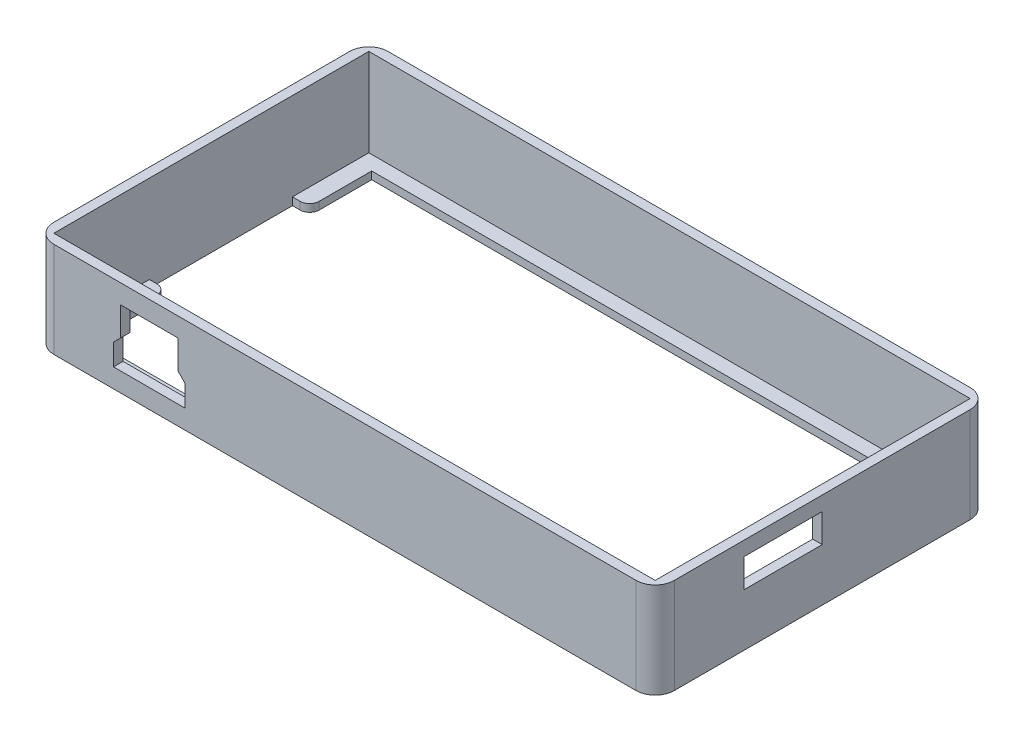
ISO-10303-21;
HEADER;
FILE_DESCRIPTION(('STEP AP214'),'2;1');
FILE_NAME('part.step','',(''),(''),'','','');
FILE_SCHEMA(('AUTOMOTIVE_DESIGN { 1 0 10303 214 1 1 1 1 }'));
ENDSEC;
DATA;
#1=APPLICATION_CONTEXT('core data for automotive mechanical design processes');
#2=APPLICATION_PROTOCOL_DEFINITION('international standard','automotive_design',2000,#1);
#3=PRODUCT_CONTEXT('',#1,'mechanical');
#4=PRODUCT('Part','Part','',(#3));
#5=PRODUCT_RELATED_PRODUCT_CATEGORY('part','',(#4));
#6=PRODUCT_DEFINITION_FORMATION('','',#4);
#7=PRODUCT_DEFINITION_CONTEXT('part definition',#1,'design');
#8=PRODUCT_DEFINITION('design','',#6,#7);
#9=PRODUCT_DEFINITION_SHAPE('','',#8);
#10=(LENGTH_UNIT() NAMED_UNIT(*) SI_UNIT(.MILLI.,.METRE.));
#11=(NAMED_UNIT(*) PLANE_ANGLE_UNIT() SI_UNIT($,.RADIAN.));
#12=(NAMED_UNIT(*) SI_UNIT($,.STERADIAN.) SOLID_ANGLE_UNIT());
#13=UNCERTAINTY_MEASURE_WITH_UNIT(LENGTH_MEASURE(1.E-05),#10,'distance_accuracy_value','');
#14=(GEOMETRIC_REPRESENTATION_CONTEXT(3) GLOBAL_UNCERTAINTY_ASSIGNED_CONTEXT((#13)) GLOBAL_UNIT_ASSIGNED_CONTEXT((#10,
#11,#12)) REPRESENTATION_CONTEXT('',''));
#15=CARTESIAN_POINT('',(0.,0.,0.));
#16=DIRECTION('',(0.,0.,1.));
#17=DIRECTION('',(1.,0.,0.));
#18=AXIS2_PLACEMENT_3D('',#15,#16,#17);
#19=CARTESIAN_POINT('',(0.,0.8,0.));
#20=DIRECTION('',(0.,-1.,0.));
#21=DIRECTION('',(0.,0.,-1.));
#22=AXIS2_PLACEMENT_3D('',#19,#20,#21);
#23=PLANE('',#22);
#24=DIRECTION('',(0.,0.,1.));
#25=VECTOR('',#24,1.);
#26=CARTESIAN_POINT('',(-29.7,0.8,6.49999999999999));
#27=LINE('',#26,#25);
#28=CARTESIAN_POINT('',(-29.7,0.8,7.49999999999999));
#29=VERTEX_POINT('',#28);
#30=CARTESIAN_POINT('',(-29.7,0.8,15.));
#31=VERTEX_POINT('',#30);
#32=EDGE_CURVE('E315',#29,#31,#27,.T.);
#33=ORIENTED_EDGE('',*,*,#32,.F.);
#34=CARTESIAN_POINT('',(-30.7,0.8,7.49999999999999));
#35=DIRECTION('',(0.,-1.,0.));
#36=DIRECTION('',(0.,0.,-1.));
#37=AXIS2_PLACEMENT_3D('',#34,#35,#36);
#38=CIRCLE('',#37,1.);
#39=CARTESIAN_POINT('',(-30.7,0.8,6.49999999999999));
#40=VERTEX_POINT('',#39);
#41=EDGE_CURVE('E410',#29,#40,#38,.F.);
#42=ORIENTED_EDGE('',*,*,#41,.T.);
#43=DIRECTION('',(1.,0.,0.));
#44=VECTOR('',#43,1.);
#45=CARTESIAN_POINT('',(-31.5,0.8,6.49999999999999));
#46=LINE('',#45,#44);
#47=CARTESIAN_POINT('',(-31.5,0.8,6.49999999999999));
#48=VERTEX_POINT('',#47);
#49=EDGE_CURVE('E340',#48,#40,#46,.T.);
#50=ORIENTED_EDGE('',*,*,#49,.F.);
#51=DIRECTION('',(0.,0.,1.));
#52=VECTOR('',#51,1.);
#53=CARTESIAN_POINT('',(-31.5,0.8,0.));
#54=LINE('',#53,#52);
#55=CARTESIAN_POINT('',(-31.5,0.8,16.5));
#56=VERTEX_POINT('',#55);
#57=EDGE_CURVE('E541',#48,#56,#54,.T.);
#58=ORIENTED_EDGE('',*,*,#57,.T.);
#59=DIRECTION('',(1.,0.,0.));
#60=VECTOR('',#59,1.);
#61=CARTESIAN_POINT('',(0.,0.8,16.5));
#62=LINE('',#61,#60);
#63=CARTESIAN_POINT('',(31.5,0.8,16.5));
#64=VERTEX_POINT('',#63);
#65=EDGE_CURVE('E595',#56,#64,#62,.T.);
#66=ORIENTED_EDGE('',*,*,#65,.T.);
#67=DIRECTION('',(0.,0.,-1.));
#68=VECTOR('',#67,1.);
#69=CARTESIAN_POINT('',(31.5,0.8,0.));
#70=LINE('',#69,#68);
#71=CARTESIAN_POINT('',(31.5,0.8,-16.5));
#72=VERTEX_POINT('',#71);
#73=EDGE_CURVE('E568',#64,#72,#70,.T.);
#74=ORIENTED_EDGE('',*,*,#73,.T.);
#75=DIRECTION('',(-1.,0.,0.));
#76=VECTOR('',#75,1.);
#77=CARTESIAN_POINT('',(0.,0.8,-16.5));
#78=LINE('',#77,#76);
#79=CARTESIAN_POINT('',(-31.5,0.8,-16.5));
#80=VERTEX_POINT('',#79);
#81=EDGE_CURVE('E571',#72,#80,#78,.T.);
#82=ORIENTED_EDGE('',*,*,#81,.T.);
#83=CARTESIAN_POINT('',(-31.5,0.8,-8.5));
#84=VERTEX_POINT('',#83);
#85=EDGE_CURVE('E592',#80,#84,#54,.T.);
#86=ORIENTED_EDGE('',*,*,#85,.T.);
#87=DIRECTION('',(-1.,0.,0.));
#88=VECTOR('',#87,1.);
#89=CARTESIAN_POINT('',(-31.5,0.8,-8.5));
#90=LINE('',#89,#88);
#91=CARTESIAN_POINT('',(-30.7,0.8,-8.5));
#92=VERTEX_POINT('',#91);
#93=EDGE_CURVE('E405',#92,#84,#90,.T.);
#94=ORIENTED_EDGE('',*,*,#93,.F.);
#95=CARTESIAN_POINT('',(-30.7,0.8,-9.5));
#96=DIRECTION('',(0.,-1.,0.));
#97=DIRECTION('',(0.,0.,-1.));
#98=AXIS2_PLACEMENT_3D('',#95,#96,#97);
#99=CIRCLE('',#98,1.);
#100=CARTESIAN_POINT('',(-29.7,0.8,-9.5));
#101=VERTEX_POINT('',#100);
#102=EDGE_CURVE('E404',#92,#101,#99,.F.);
#103=ORIENTED_EDGE('',*,*,#102,.T.);
#104=DIRECTION('',(0.,0.,1.));
#105=VECTOR('',#104,1.);
#106=CARTESIAN_POINT('',(-29.7,0.8,-8.5));
#107=LINE('',#106,#105);
#108=CARTESIAN_POINT('',(-29.7,0.8,-15.));
#109=VERTEX_POINT('',#108);
#110=EDGE_CURVE('E408',#109,#101,#107,.T.);
#111=ORIENTED_EDGE('',*,*,#110,.F.);
#112=DIRECTION('',(-1.,0.,0.));
#113=VECTOR('',#112,1.);
#114=CARTESIAN_POINT('',(-29.7,0.8,-15.));
#115=LINE('',#114,#113);
#116=CARTESIAN_POINT('',(30.5,0.8,-15.));
#117=VERTEX_POINT('',#116);
#118=EDGE_CURVE('E656',#117,#109,#115,.T.);
#119=ORIENTED_EDGE('',*,*,#118,.F.);
#120=DIRECTION('',(0.,0.,-1.));
#121=VECTOR('',#120,1.);
#122=CARTESIAN_POINT('',(30.5,0.8,-15.));
#123=LINE('',#122,#121);
#124=CARTESIAN_POINT('',(30.5,0.8,15.));
#125=VERTEX_POINT('',#124);
#126=EDGE_CURVE('E343',#125,#117,#123,.T.);
#127=ORIENTED_EDGE('',*,*,#126,.F.);
#128=DIRECTION('',(1.,0.,0.));
#129=VECTOR('',#128,1.);
#130=CARTESIAN_POINT('',(30.5,0.8,15.));
#131=LINE('',#130,#129);
#132=EDGE_CURVE('E559',#31,#125,#131,.T.);
#133=ORIENTED_EDGE('',*,*,#132,.F.);
#134=EDGE_LOOP('',(#33,#42,#50,#58,#66,#74,#82,#86,#94,#103,#111,#119,#127,#133));
#135=FACE_BOUND('',#134,.T.);
#136=ADVANCED_FACE('F37',(#135),#23,.F.);
#137=CARTESIAN_POINT('',(0.,10.,0.));
#138=DIRECTION('',(0.,-1.,0.));
#139=DIRECTION('',(0.,0.,-1.));
#140=AXIS2_PLACEMENT_3D('',#137,#138,#139);
#141=PLANE('',#140);
#142=DIRECTION('',(0.,0.,-1.));
#143=VECTOR('',#142,1.);
#144=CARTESIAN_POINT('',(32.5,10.,17.5));
#145=LINE('',#144,#143);
#146=CARTESIAN_POINT('',(32.5,10.,15.5));
#147=VERTEX_POINT('',#146);
#148=CARTESIAN_POINT('',(32.5,10.,-15.5));
#149=VERTEX_POINT('',#148);
#150=EDGE_CURVE('E599',#147,#149,#145,.T.);
#151=ORIENTED_EDGE('',*,*,#150,.T.);
#152=CARTESIAN_POINT('',(30.5,10.,-15.5));
#153=DIRECTION('',(0.,-1.,0.));
#154=DIRECTION('',(0.,0.,-1.));
#155=AXIS2_PLACEMENT_3D('',#152,#153,#154);
#156=CIRCLE('',#155,2.);
#157=CARTESIAN_POINT('',(30.5,10.,-17.5));
#158=VERTEX_POINT('',#157);
#159=EDGE_CURVE('E383',#149,#158,#156,.F.);
#160=ORIENTED_EDGE('',*,*,#159,.T.);
#161=DIRECTION('',(-1.,0.,0.));
#162=VECTOR('',#161,1.);
#163=CARTESIAN_POINT('',(-32.5,10.,-17.5));
#164=LINE('',#163,#162);
#165=CARTESIAN_POINT('',(-30.5,10.,-17.5));
#166=VERTEX_POINT('',#165);
#167=EDGE_CURVE('E613',#158,#166,#164,.T.);
#168=ORIENTED_EDGE('',*,*,#167,.T.);
#169=CARTESIAN_POINT('',(-30.5,10.,-15.5));
#170=DIRECTION('',(0.,-1.,0.));
#171=DIRECTION('',(0.,0.,-1.));
#172=AXIS2_PLACEMENT_3D('',#169,#170,#171);
#173=CIRCLE('',#172,2.);
#174=CARTESIAN_POINT('',(-32.5,10.,-15.5));
#175=VERTEX_POINT('',#174);
#176=EDGE_CURVE('E379',#166,#175,#173,.F.);
#177=ORIENTED_EDGE('',*,*,#176,.T.);
#178=DIRECTION('',(0.,0.,1.));
#179=VECTOR('',#178,1.);
#180=CARTESIAN_POINT('',(-32.5,10.,17.5));
#181=LINE('',#180,#179);
#182=CARTESIAN_POINT('',(-32.5,10.,15.5));
#183=VERTEX_POINT('',#182);
#184=EDGE_CURVE('E610',#175,#183,#181,.T.);
#185=ORIENTED_EDGE('',*,*,#184,.T.);
#186=CARTESIAN_POINT('',(-30.5,10.,15.5));
#187=DIRECTION('',(0.,-1.,0.));
#188=DIRECTION('',(0.,0.,-1.));
#189=AXIS2_PLACEMENT_3D('',#186,#187,#188);
#190=CIRCLE('',#189,2.);
#191=CARTESIAN_POINT('',(-30.5,10.,17.5));
#192=VERTEX_POINT('',#191);
#193=EDGE_CURVE('E377',#183,#192,#190,.F.);
#194=ORIENTED_EDGE('',*,*,#193,.T.);
#195=DIRECTION('',(1.,0.,0.));
#196=VECTOR('',#195,1.);
#197=CARTESIAN_POINT('',(-32.5,10.,17.5));
#198=LINE('',#197,#196);
#199=CARTESIAN_POINT('',(30.5,10.,17.5));
#200=VERTEX_POINT('',#199);
#201=EDGE_CURVE('E361',#192,#200,#198,.T.);
#202=ORIENTED_EDGE('',*,*,#201,.T.);
#203=CARTESIAN_POINT('',(30.5,10.,15.5));
#204=DIRECTION('',(0.,-1.,0.));
#205=DIRECTION('',(0.,0.,-1.));
#206=AXIS2_PLACEMENT_3D('',#203,#204,#205);
#207=CIRCLE('',#206,2.);
#208=EDGE_CURVE('E381',#200,#147,#207,.F.);
#209=ORIENTED_EDGE('',*,*,#208,.T.);
#210=EDGE_LOOP('',(#151,#160,#168,#177,#185,#194,#202,#209));
#211=FACE_BOUND('',#210,.T.);
#212=DIRECTION('',(0.,0.,-1.));
#213=VECTOR('',#212,1.);
#214=CARTESIAN_POINT('',(31.5,10.,0.));
#215=LINE('',#214,#213);
#216=CARTESIAN_POINT('',(31.5,10.,16.5));
#217=VERTEX_POINT('',#216);
#218=CARTESIAN_POINT('',(31.5,10.,-16.5));
#219=VERTEX_POINT('',#218);
#220=EDGE_CURVE('E624',#217,#219,#215,.T.);
#221=ORIENTED_EDGE('',*,*,#220,.F.);
#222=DIRECTION('',(1.,0.,0.));
#223=VECTOR('',#222,1.);
#224=CARTESIAN_POINT('',(0.,10.,16.5));
#225=LINE('',#224,#223);
#226=CARTESIAN_POINT('',(-31.5,10.,16.5));
#227=VERTEX_POINT('',#226);
#228=EDGE_CURVE('E581',#227,#217,#225,.T.);
#229=ORIENTED_EDGE('',*,*,#228,.F.);
#230=DIRECTION('',(0.,0.,1.));
#231=VECTOR('',#230,1.);
#232=CARTESIAN_POINT('',(-31.5,10.,0.));
#233=LINE('',#232,#231);
#234=CARTESIAN_POINT('',(-31.5,10.,-16.5));
#235=VERTEX_POINT('',#234);
#236=EDGE_CURVE('E619',#235,#227,#233,.T.);
#237=ORIENTED_EDGE('',*,*,#236,.F.);
#238=DIRECTION('',(-1.,0.,0.));
#239=VECTOR('',#238,1.);
#240=CARTESIAN_POINT('',(0.,10.,-16.5));
#241=LINE('',#240,#239);
#242=EDGE_CURVE('E622',#219,#235,#241,.T.);
#243=ORIENTED_EDGE('',*,*,#242,.F.);
#244=EDGE_LOOP('',(#221,#229,#237,#243));
#245=FACE_BOUND('',#244,.T.);
#246=ADVANCED_FACE('F467',(#211,#245),#141,.F.);
#247=CARTESIAN_POINT('',(32.5,10.,17.5));
#248=DIRECTION('',(-1.,0.,0.));
#249=DIRECTION('',(0.,0.,1.));
#250=AXIS2_PLACEMENT_3D('',#247,#248,#249);
#251=PLANE('',#250);
#252=DIRECTION('',(0.,1.,0.));
#253=VECTOR('',#252,1.);
#254=CARTESIAN_POINT('',(32.5,5.5,0.));
#255=LINE('',#254,#253);
#256=CARTESIAN_POINT('',(32.5,5.5,0.));
#257=VERTEX_POINT('',#256);
#258=CARTESIAN_POINT('',(32.5,8.5,0.));
#259=VERTEX_POINT('',#258);
#260=EDGE_CURVE('E319',#257,#259,#255,.T.);
#261=ORIENTED_EDGE('',*,*,#260,.F.);
#262=DIRECTION('',(0.,0.,-1.));
#263=VECTOR('',#262,1.);
#264=CARTESIAN_POINT('',(32.5,5.5,8.2));
#265=LINE('',#264,#263);
#266=CARTESIAN_POINT('',(32.5,5.5,8.2));
#267=VERTEX_POINT('',#266);
#268=EDGE_CURVE('E322',#267,#257,#265,.T.);
#269=ORIENTED_EDGE('',*,*,#268,.F.);
#270=DIRECTION('',(0.,-1.,0.));
#271=VECTOR('',#270,1.);
#272=CARTESIAN_POINT('',(32.5,8.5,8.2));
#273=LINE('',#272,#271);
#274=CARTESIAN_POINT('',(32.5,8.5,8.2));
#275=VERTEX_POINT('',#274);
#276=EDGE_CURVE('E312',#275,#267,#273,.T.);
#277=ORIENTED_EDGE('',*,*,#276,.F.);
#278=DIRECTION('',(0.,0.,1.));
#279=VECTOR('',#278,1.);
#280=CARTESIAN_POINT('',(32.5,8.5,0.));
#281=LINE('',#280,#279);
#282=EDGE_CURVE('E316',#259,#275,#281,.T.);
#283=ORIENTED_EDGE('',*,*,#282,.F.);
#284=EDGE_LOOP('',(#261,#269,#277,#283));
#285=FACE_BOUND('',#284,.T.);
#286=DIRECTION('',(0.,0.,-1.));
#287=VECTOR('',#286,1.);
#288=CARTESIAN_POINT('',(32.5,0.,17.5));
#289=LINE('',#288,#287);
#290=CARTESIAN_POINT('',(32.5,0.,15.5));
#291=VERTEX_POINT('',#290);
#292=CARTESIAN_POINT('',(32.5,0.,-15.5));
#293=VERTEX_POINT('',#292);
#294=EDGE_CURVE('E575',#291,#293,#289,.T.);
#295=ORIENTED_EDGE('',*,*,#294,.T.);
#296=DIRECTION('',(0.,-1.,0.));
#297=VECTOR('',#296,1.);
#298=CARTESIAN_POINT('',(32.5,10.,-15.5));
#299=LINE('',#298,#297);
#300=EDGE_CURVE('E375',#293,#149,#299,.F.);
#301=ORIENTED_EDGE('',*,*,#300,.T.);
#302=ORIENTED_EDGE('',*,*,#150,.F.);
#303=DIRECTION('',(0.,-1.,0.));
#304=VECTOR('',#303,1.);
#305=CARTESIAN_POINT('',(32.5,10.,15.5));
#306=LINE('',#305,#304);
#307=EDGE_CURVE('E372',#147,#291,#306,.T.);
#308=ORIENTED_EDGE('',*,*,#307,.T.);
#309=EDGE_LOOP('',(#295,#301,#302,#308));
#310=FACE_BOUND('',#309,.T.);
#311=ADVANCED_FACE('F473',(#285,#310),#251,.F.);
#312=CARTESIAN_POINT('',(-32.5,10.,-17.5));
#313=DIRECTION('',(0.,0.,1.));
#314=DIRECTION('',(1.,0.,0.));
#315=AXIS2_PLACEMENT_3D('',#312,#313,#314);
#316=PLANE('',#315);
#317=ORIENTED_EDGE('',*,*,#167,.F.);
#318=DIRECTION('',(0.,-1.,0.));
#319=VECTOR('',#318,1.);
#320=CARTESIAN_POINT('',(30.5,10.,-17.5));
#321=LINE('',#320,#319);
#322=CARTESIAN_POINT('',(30.5,0.,-17.5));
#323=VERTEX_POINT('',#322);
#324=EDGE_CURVE('E360',#158,#323,#321,.T.);
#325=ORIENTED_EDGE('',*,*,#324,.T.);
#326=DIRECTION('',(-1.,0.,0.));
#327=VECTOR('',#326,1.);
#328=CARTESIAN_POINT('',(-32.5,0.,-17.5));
#329=LINE('',#328,#327);
#330=CARTESIAN_POINT('',(-30.5,0.,-17.5));
#331=VERTEX_POINT('',#330);
#332=EDGE_CURVE('E603',#323,#331,#329,.T.);
#333=ORIENTED_EDGE('',*,*,#332,.T.);
#334=DIRECTION('',(0.,-1.,0.));
#335=VECTOR('',#334,1.);
#336=CARTESIAN_POINT('',(-30.5,10.,-17.5));
#337=LINE('',#336,#335);
#338=EDGE_CURVE('E358',#331,#166,#337,.F.);
#339=ORIENTED_EDGE('',*,*,#338,.T.);
#340=EDGE_LOOP('',(#317,#325,#333,#339));
#341=FACE_BOUND('',#340,.T.);
#342=ADVANCED_FACE('F490',(#341),#316,.F.);
#343=CARTESIAN_POINT('',(-32.5,10.,17.5));
#344=DIRECTION('',(1.,0.,0.));
#345=DIRECTION('',(0.,0.,-1.));
#346=AXIS2_PLACEMENT_3D('',#343,#344,#345);
#347=PLANE('',#346);
#348=ORIENTED_EDGE('',*,*,#184,.F.);
#349=DIRECTION('',(0.,-1.,0.));
#350=VECTOR('',#349,1.);
#351=CARTESIAN_POINT('',(-32.5,10.,-15.5));
#352=LINE('',#351,#350);
#353=CARTESIAN_POINT('',(-32.5,0.,-15.5));
#354=VERTEX_POINT('',#353);
#355=EDGE_CURVE('E392',#175,#354,#352,.T.);
#356=ORIENTED_EDGE('',*,*,#355,.T.);
#357=DIRECTION('',(0.,0.,1.));
#358=VECTOR('',#357,1.);
#359=CARTESIAN_POINT('',(-32.5,0.,17.5));
#360=LINE('',#359,#358);
#361=CARTESIAN_POINT('',(-32.5,0.,15.5));
#362=VERTEX_POINT('',#361);
#363=EDGE_CURVE('E600',#354,#362,#360,.T.);
#364=ORIENTED_EDGE('',*,*,#363,.T.);
#365=DIRECTION('',(0.,-1.,0.));
#366=VECTOR('',#365,1.);
#367=CARTESIAN_POINT('',(-32.5,10.,15.5));
#368=LINE('',#367,#366);
#369=EDGE_CURVE('E390',#362,#183,#368,.F.);
#370=ORIENTED_EDGE('',*,*,#369,.T.);
#371=EDGE_LOOP('',(#348,#356,#364,#370));
#372=FACE_BOUND('',#371,.T.);
#373=ADVANCED_FACE('F487',(#372),#347,.F.);
#374=CARTESIAN_POINT('',(-32.5,10.,17.5));
#375=DIRECTION('',(0.,0.,-1.));
#376=DIRECTION('',(-1.,0.,0.));
#377=AXIS2_PLACEMENT_3D('',#374,#375,#376);
#378=PLANE('',#377);
#379=DIRECTION('',(0.,1.,0.));
#380=VECTOR('',#379,1.);
#381=CARTESIAN_POINT('',(-16.75,4.25,17.5));
#382=LINE('',#381,#380);
#383=CARTESIAN_POINT('',(-16.75,2.,17.5));
#384=VERTEX_POINT('',#383);
#385=CARTESIAN_POINT('',(-16.75,4.25,17.5));
#386=VERTEX_POINT('',#385);
#387=EDGE_CURVE('E269',#384,#386,#382,.T.);
#388=ORIENTED_EDGE('',*,*,#387,.F.);
#389=DIRECTION('',(1.,0.,0.));
#390=VECTOR('',#389,1.);
#391=CARTESIAN_POINT('',(-23.5,2.,17.5));
#392=LINE('',#391,#390);
#393=CARTESIAN_POINT('',(-24.25,2.,17.5));
#394=VERTEX_POINT('',#393);
#395=EDGE_CURVE('E52',#394,#384,#392,.T.);
#396=ORIENTED_EDGE('',*,*,#395,.F.);
#397=DIRECTION('',(0.,-1.,0.));
#398=VECTOR('',#397,1.);
#399=CARTESIAN_POINT('',(-24.25,4.24999999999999,17.5));
#400=LINE('',#399,#398);
#401=CARTESIAN_POINT('',(-24.25,4.24999999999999,17.5));
#402=VERTEX_POINT('',#401);
#403=EDGE_CURVE('E290',#402,#394,#400,.T.);
#404=ORIENTED_EDGE('',*,*,#403,.F.);
#405=DIRECTION('',(-0.707106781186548,-0.707106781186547,0.));
#406=VECTOR('',#405,1.);
#407=CARTESIAN_POINT('',(-23.5,5.,17.5));
#408=LINE('',#407,#406);
#409=CARTESIAN_POINT('',(-23.5,5.,17.5));
#410=VERTEX_POINT('',#409);
#411=EDGE_CURVE('E287',#410,#402,#408,.T.);
#412=ORIENTED_EDGE('',*,*,#411,.F.);
#413=DIRECTION('',(0.,-1.,0.));
#414=VECTOR('',#413,1.);
#415=CARTESIAN_POINT('',(-23.5,8.,17.5));
#416=LINE('',#415,#414);
#417=CARTESIAN_POINT('',(-23.5,8.,17.5));
#418=VERTEX_POINT('',#417);
#419=EDGE_CURVE('E284',#418,#410,#416,.T.);
#420=ORIENTED_EDGE('',*,*,#419,.F.);
#421=DIRECTION('',(-1.,0.,0.));
#422=VECTOR('',#421,1.);
#423=CARTESIAN_POINT('',(-23.5,8.,17.5));
#424=LINE('',#423,#422);
#425=CARTESIAN_POINT('',(-17.5,8.,17.5));
#426=VERTEX_POINT('',#425);
#427=EDGE_CURVE('E279',#426,#418,#424,.T.);
#428=ORIENTED_EDGE('',*,*,#427,.F.);
#429=DIRECTION('',(0.,1.,0.));
#430=VECTOR('',#429,1.);
#431=CARTESIAN_POINT('',(-17.5,8.,17.5));
#432=LINE('',#431,#430);
#433=CARTESIAN_POINT('',(-17.5,5.,17.5));
#434=VERTEX_POINT('',#433);
#435=EDGE_CURVE('E277',#434,#426,#432,.T.);
#436=ORIENTED_EDGE('',*,*,#435,.F.);
#437=DIRECTION('',(-0.707106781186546,0.707106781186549,0.));
#438=VECTOR('',#437,1.);
#439=CARTESIAN_POINT('',(-17.5,5.,17.5));
#440=LINE('',#439,#438);
#441=EDGE_CURVE('E260',#386,#434,#440,.T.);
#442=ORIENTED_EDGE('',*,*,#441,.F.);
#443=EDGE_LOOP('',(#388,#396,#404,#412,#420,#428,#436,#442));
#444=FACE_BOUND('',#443,.T.);
#445=DIRECTION('',(1.,0.,0.));
#446=VECTOR('',#445,1.);
#447=CARTESIAN_POINT('',(-32.5,0.,17.5));
#448=LINE('',#447,#446);
#449=CARTESIAN_POINT('',(-30.5,0.,17.5));
#450=VERTEX_POINT('',#449);
#451=CARTESIAN_POINT('',(30.5,0.,17.5));
#452=VERTEX_POINT('',#451);
#453=EDGE_CURVE('E596',#450,#452,#448,.T.);
#454=ORIENTED_EDGE('',*,*,#453,.T.);
#455=DIRECTION('',(0.,-1.,0.));
#456=VECTOR('',#455,1.);
#457=CARTESIAN_POINT('',(30.5,10.,17.5));
#458=LINE('',#457,#456);
#459=EDGE_CURVE('E388',#452,#200,#458,.F.);
#460=ORIENTED_EDGE('',*,*,#459,.T.);
#461=ORIENTED_EDGE('',*,*,#201,.F.);
#462=DIRECTION('',(0.,-1.,0.));
#463=VECTOR('',#462,1.);
#464=CARTESIAN_POINT('',(-30.5,10.,17.5));
#465=LINE('',#464,#463);
#466=EDGE_CURVE('E385',#192,#450,#465,.T.);
#467=ORIENTED_EDGE('',*,*,#466,.T.);
#468=EDGE_LOOP('',(#454,#460,#461,#467));
#469=FACE_BOUND('',#468,.T.);
#470=ADVANCED_FACE('F273',(#444,#469),#378,.F.);
#471=CARTESIAN_POINT('',(0.,0.,0.));
#472=DIRECTION('',(0.,-1.,0.));
#473=DIRECTION('',(0.,0.,-1.));
#474=AXIS2_PLACEMENT_3D('',#471,#472,#473);
#475=PLANE('',#474);
#476=DIRECTION('',(-1.,0.,0.));
#477=VECTOR('',#476,1.);
#478=CARTESIAN_POINT('',(-31.5,0.,6.49999999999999));
#479=LINE('',#478,#477);
#480=CARTESIAN_POINT('',(-30.7,0.,6.49999999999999));
#481=VERTEX_POINT('',#480);
#482=CARTESIAN_POINT('',(-31.5,0.,6.49999999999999));
#483=VERTEX_POINT('',#482);
#484=EDGE_CURVE('E531',#481,#483,#479,.T.);
#485=ORIENTED_EDGE('',*,*,#484,.F.);
#486=CARTESIAN_POINT('',(-30.7,0.,7.49999999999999));
#487=DIRECTION('',(0.,-1.,0.));
#488=DIRECTION('',(0.,0.,-1.));
#489=AXIS2_PLACEMENT_3D('',#486,#487,#488);
#490=CIRCLE('',#489,1.);
#491=CARTESIAN_POINT('',(-29.7,0.,7.49999999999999));
#492=VERTEX_POINT('',#491);
#493=EDGE_CURVE('E400',#481,#492,#490,.T.);
#494=ORIENTED_EDGE('',*,*,#493,.T.);
#495=DIRECTION('',(0.,0.,-1.));
#496=VECTOR('',#495,1.);
#497=CARTESIAN_POINT('',(-29.7,0.,6.49999999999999));
#498=LINE('',#497,#496);
#499=CARTESIAN_POINT('',(-29.7,0.,15.));
#500=VERTEX_POINT('',#499);
#501=EDGE_CURVE('E548',#500,#492,#498,.T.);
#502=ORIENTED_EDGE('',*,*,#501,.F.);
#503=DIRECTION('',(-1.,0.,0.));
#504=VECTOR('',#503,1.);
#505=CARTESIAN_POINT('',(30.5,0.,15.));
#506=LINE('',#505,#504);
#507=CARTESIAN_POINT('',(30.5,0.,15.));
#508=VERTEX_POINT('',#507);
#509=EDGE_CURVE('E661',#508,#500,#506,.T.);
#510=ORIENTED_EDGE('',*,*,#509,.F.);
#511=DIRECTION('',(0.,0.,1.));
#512=VECTOR('',#511,1.);
#513=CARTESIAN_POINT('',(30.5,0.,-15.));
#514=LINE('',#513,#512);
#515=CARTESIAN_POINT('',(30.5,0.,-15.));
#516=VERTEX_POINT('',#515);
#517=EDGE_CURVE('E407',#516,#508,#514,.T.);
#518=ORIENTED_EDGE('',*,*,#517,.F.);
#519=DIRECTION('',(1.,0.,0.));
#520=VECTOR('',#519,1.);
#521=CARTESIAN_POINT('',(-29.7,0.,-15.));
#522=LINE('',#521,#520);
#523=CARTESIAN_POINT('',(-29.7,0.,-15.));
#524=VERTEX_POINT('',#523);
#525=EDGE_CURVE('E553',#524,#516,#522,.T.);
#526=ORIENTED_EDGE('',*,*,#525,.F.);
#527=DIRECTION('',(0.,0.,-1.));
#528=VECTOR('',#527,1.);
#529=CARTESIAN_POINT('',(-29.7,0.,-8.5));
#530=LINE('',#529,#528);
#531=CARTESIAN_POINT('',(-29.7,0.,-9.5));
#532=VERTEX_POINT('',#531);
#533=EDGE_CURVE('E546',#532,#524,#530,.T.);
#534=ORIENTED_EDGE('',*,*,#533,.F.);
#535=CARTESIAN_POINT('',(-30.7,0.,-9.5));
#536=DIRECTION('',(0.,-1.,0.));
#537=DIRECTION('',(0.,0.,-1.));
#538=AXIS2_PLACEMENT_3D('',#535,#536,#537);
#539=CIRCLE('',#538,1.);
#540=CARTESIAN_POINT('',(-30.7,0.,-8.5));
#541=VERTEX_POINT('',#540);
#542=EDGE_CURVE('E398',#532,#541,#539,.T.);
#543=ORIENTED_EDGE('',*,*,#542,.T.);
#544=DIRECTION('',(1.,0.,0.));
#545=VECTOR('',#544,1.);
#546=CARTESIAN_POINT('',(-31.5,0.,-8.5));
#547=LINE('',#546,#545);
#548=CARTESIAN_POINT('',(-31.5,0.,-8.5));
#549=VERTEX_POINT('',#548);
#550=EDGE_CURVE('E544',#549,#541,#547,.T.);
#551=ORIENTED_EDGE('',*,*,#550,.F.);
#552=DIRECTION('',(0.,0.,-1.));
#553=VECTOR('',#552,1.);
#554=CARTESIAN_POINT('',(-31.5,0.,6.49999999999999));
#555=LINE('',#554,#553);
#556=EDGE_CURVE('E538',#483,#549,#555,.T.);
#557=ORIENTED_EDGE('',*,*,#556,.F.);
#558=EDGE_LOOP('',(#485,#494,#502,#510,#518,#526,#534,#543,#551,#557));
#559=FACE_BOUND('',#558,.T.);
#560=ORIENTED_EDGE('',*,*,#332,.F.);
#561=CARTESIAN_POINT('',(30.5,0.,-15.5));
#562=DIRECTION('',(0.,-1.,0.));
#563=DIRECTION('',(0.,0.,-1.));
#564=AXIS2_PLACEMENT_3D('',#561,#562,#563);
#565=CIRCLE('',#564,2.);
#566=EDGE_CURVE('E370',#323,#293,#565,.T.);
#567=ORIENTED_EDGE('',*,*,#566,.T.);
#568=ORIENTED_EDGE('',*,*,#294,.F.);
#569=CARTESIAN_POINT('',(30.5,0.,15.5));
#570=DIRECTION('',(0.,-1.,0.));
#571=DIRECTION('',(0.,0.,-1.));
#572=AXIS2_PLACEMENT_3D('',#569,#570,#571);
#573=CIRCLE('',#572,2.);
#574=EDGE_CURVE('E368',#291,#452,#573,.T.);
#575=ORIENTED_EDGE('',*,*,#574,.T.);
#576=ORIENTED_EDGE('',*,*,#453,.F.);
#577=CARTESIAN_POINT('',(-30.5,0.,15.5));
#578=DIRECTION('',(0.,-1.,0.));
#579=DIRECTION('',(0.,0.,-1.));
#580=AXIS2_PLACEMENT_3D('',#577,#578,#579);
#581=CIRCLE('',#580,2.);
#582=EDGE_CURVE('E364',#450,#362,#581,.T.);
#583=ORIENTED_EDGE('',*,*,#582,.T.);
#584=ORIENTED_EDGE('',*,*,#363,.F.);
#585=CARTESIAN_POINT('',(-30.5,0.,-15.5));
#586=DIRECTION('',(0.,-1.,0.));
#587=DIRECTION('',(0.,0.,-1.));
#588=AXIS2_PLACEMENT_3D('',#585,#586,#587);
#589=CIRCLE('',#588,2.);
#590=EDGE_CURVE('E366',#354,#331,#589,.T.);
#591=ORIENTED_EDGE('',*,*,#590,.T.);
#592=EDGE_LOOP('',(#560,#567,#568,#575,#576,#583,#584,#591));
#593=FACE_BOUND('',#592,.T.);
#594=ADVANCED_FACE('F480',(#559,#593),#475,.T.);
#595=CARTESIAN_POINT('',(31.5,10.,17.5));
#596=DIRECTION('',(-1.,0.,0.));
#597=DIRECTION('',(0.,0.,1.));
#598=AXIS2_PLACEMENT_3D('',#595,#596,#597);
#599=PLANE('',#598);
#600=DIRECTION('',(0.,0.,-1.));
#601=VECTOR('',#600,1.);
#602=CARTESIAN_POINT('',(31.5,5.5,8.2));
#603=LINE('',#602,#601);
#604=CARTESIAN_POINT('',(31.5,5.5,8.2));
#605=VERTEX_POINT('',#604);
#606=CARTESIAN_POINT('',(31.5,5.5,0.));
#607=VERTEX_POINT('',#606);
#608=EDGE_CURVE('E296',#605,#607,#603,.T.);
#609=ORIENTED_EDGE('',*,*,#608,.T.);
#610=DIRECTION('',(0.,1.,0.));
#611=VECTOR('',#610,1.);
#612=CARTESIAN_POINT('',(31.5,5.5,0.));
#613=LINE('',#612,#611);
#614=CARTESIAN_POINT('',(31.5,8.5,0.));
#615=VERTEX_POINT('',#614);
#616=EDGE_CURVE('E307',#607,#615,#613,.T.);
#617=ORIENTED_EDGE('',*,*,#616,.T.);
#618=DIRECTION('',(0.,0.,1.));
#619=VECTOR('',#618,1.);
#620=CARTESIAN_POINT('',(31.5,8.5,0.));
#621=LINE('',#620,#619);
#622=CARTESIAN_POINT('',(31.5,8.5,8.2));
#623=VERTEX_POINT('',#622);
#624=EDGE_CURVE('E331',#615,#623,#621,.T.);
#625=ORIENTED_EDGE('',*,*,#624,.T.);
#626=DIRECTION('',(0.,-1.,0.));
#627=VECTOR('',#626,1.);
#628=CARTESIAN_POINT('',(31.5,8.5,8.2));
#629=LINE('',#628,#627);
#630=EDGE_CURVE('E327',#623,#605,#629,.T.);
#631=ORIENTED_EDGE('',*,*,#630,.T.);
#632=EDGE_LOOP('',(#609,#617,#625,#631));
#633=FACE_BOUND('',#632,.T.);
#634=ORIENTED_EDGE('',*,*,#73,.F.);
#635=DIRECTION('',(0.,-1.,0.));
#636=VECTOR('',#635,1.);
#637=CARTESIAN_POINT('',(31.5,10.,16.5));
#638=LINE('',#637,#636);
#639=EDGE_CURVE('E577',#217,#64,#638,.T.);
#640=ORIENTED_EDGE('',*,*,#639,.F.);
#641=ORIENTED_EDGE('',*,*,#220,.T.);
#642=DIRECTION('',(0.,-1.,0.));
#643=VECTOR('',#642,1.);
#644=CARTESIAN_POINT('',(31.5,10.,-16.5));
#645=LINE('',#644,#643);
#646=EDGE_CURVE('E572',#219,#72,#645,.T.);
#647=ORIENTED_EDGE('',*,*,#646,.T.);
#648=EDGE_LOOP('',(#634,#640,#641,#647));
#649=FACE_BOUND('',#648,.T.);
#650=ADVANCED_FACE('F483',(#633,#649),#599,.T.);
#651=CARTESIAN_POINT('',(-32.5,10.,-16.5));
#652=DIRECTION('',(0.,0.,1.));
#653=DIRECTION('',(1.,0.,0.));
#654=AXIS2_PLACEMENT_3D('',#651,#652,#653);
#655=PLANE('',#654);
#656=ORIENTED_EDGE('',*,*,#81,.F.);
#657=ORIENTED_EDGE('',*,*,#646,.F.);
#658=ORIENTED_EDGE('',*,*,#242,.T.);
#659=DIRECTION('',(0.,-1.,0.));
#660=VECTOR('',#659,1.);
#661=CARTESIAN_POINT('',(-31.5,10.,-16.5));
#662=LINE('',#661,#660);
#663=EDGE_CURVE('E576',#235,#80,#662,.T.);
#664=ORIENTED_EDGE('',*,*,#663,.T.);
#665=EDGE_LOOP('',(#656,#657,#658,#664));
#666=FACE_BOUND('',#665,.T.);
#667=ADVANCED_FACE('F634',(#666),#655,.T.);
#668=CARTESIAN_POINT('',(-31.5,10.,17.5));
#669=DIRECTION('',(1.,0.,0.));
#670=DIRECTION('',(0.,0.,-1.));
#671=AXIS2_PLACEMENT_3D('',#668,#669,#670);
#672=PLANE('',#671);
#673=ORIENTED_EDGE('',*,*,#85,.F.);
#674=ORIENTED_EDGE('',*,*,#663,.F.);
#675=ORIENTED_EDGE('',*,*,#236,.T.);
#676=DIRECTION('',(0.,-1.,0.));
#677=VECTOR('',#676,1.);
#678=CARTESIAN_POINT('',(-31.5,10.,16.5));
#679=LINE('',#678,#677);
#680=EDGE_CURVE('E580',#227,#56,#679,.T.);
#681=ORIENTED_EDGE('',*,*,#680,.T.);
#682=ORIENTED_EDGE('',*,*,#57,.F.);
#683=DIRECTION('',(0.,-1.,0.));
#684=VECTOR('',#683,1.);
#685=CARTESIAN_POINT('',(-31.5,10.001,6.49999999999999));
#686=LINE('',#685,#684);
#687=EDGE_CURVE('E351',#48,#483,#686,.T.);
#688=ORIENTED_EDGE('',*,*,#687,.T.);
#689=ORIENTED_EDGE('',*,*,#556,.T.);
#690=DIRECTION('',(0.,-1.,0.));
#691=VECTOR('',#690,1.);
#692=CARTESIAN_POINT('',(-31.5,10.001,-8.5));
#693=LINE('',#692,#691);
#694=EDGE_CURVE('E354',#84,#549,#693,.T.);
#695=ORIENTED_EDGE('',*,*,#694,.F.);
#696=EDGE_LOOP('',(#673,#674,#675,#681,#682,#688,#689,#695));
#697=FACE_BOUND('',#696,.T.);
#698=ADVANCED_FACE('F536',(#697),#672,.T.);
#699=CARTESIAN_POINT('',(-32.5,10.,16.5));
#700=DIRECTION('',(0.,0.,-1.));
#701=DIRECTION('',(-1.,0.,0.));
#702=AXIS2_PLACEMENT_3D('',#699,#700,#701);
#703=PLANE('',#702);
#704=DIRECTION('',(-1.,0.,0.));
#705=VECTOR('',#704,1.);
#706=CARTESIAN_POINT('',(-32.5,2.,16.5));
#707=LINE('',#706,#705);
#708=CARTESIAN_POINT('',(-16.75,2.,16.5));
#709=VERTEX_POINT('',#708);
#710=CARTESIAN_POINT('',(-24.25,2.,16.5));
#711=VERTEX_POINT('',#710);
#712=EDGE_CURVE('E11',#709,#711,#707,.T.);
#713=ORIENTED_EDGE('',*,*,#712,.F.);
#714=DIRECTION('',(0.,-1.,0.));
#715=VECTOR('',#714,1.);
#716=CARTESIAN_POINT('',(-16.75,10.,16.5));
#717=LINE('',#716,#715);
#718=CARTESIAN_POINT('',(-16.75,4.25,16.5));
#719=VERTEX_POINT('',#718);
#720=EDGE_CURVE('E417',#719,#709,#717,.T.);
#721=ORIENTED_EDGE('',*,*,#720,.F.);
#722=DIRECTION('',(0.707106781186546,-0.707106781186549,0.));
#723=VECTOR('',#722,1.);
#724=CARTESIAN_POINT('',(-27.5,15.,16.5));
#725=LINE('',#724,#723);
#726=CARTESIAN_POINT('',(-17.5,5.,16.5));
#727=VERTEX_POINT('',#726);
#728=EDGE_CURVE('E263',#727,#719,#725,.T.);
#729=ORIENTED_EDGE('',*,*,#728,.F.);
#730=DIRECTION('',(0.,-1.,0.));
#731=VECTOR('',#730,1.);
#732=CARTESIAN_POINT('',(-17.5,10.,16.5));
#733=LINE('',#732,#731);
#734=CARTESIAN_POINT('',(-17.5,8.,16.5));
#735=VERTEX_POINT('',#734);
#736=EDGE_CURVE('E420',#735,#727,#733,.T.);
#737=ORIENTED_EDGE('',*,*,#736,.F.);
#738=DIRECTION('',(1.,0.,0.));
#739=VECTOR('',#738,1.);
#740=CARTESIAN_POINT('',(-32.5,8.,16.5));
#741=LINE('',#740,#739);
#742=CARTESIAN_POINT('',(-23.5,8.,16.5));
#743=VERTEX_POINT('',#742);
#744=EDGE_CURVE('E422',#743,#735,#741,.T.);
#745=ORIENTED_EDGE('',*,*,#744,.F.);
#746=DIRECTION('',(0.,1.,0.));
#747=VECTOR('',#746,1.);
#748=CARTESIAN_POINT('',(-23.5,10.,16.5));
#749=LINE('',#748,#747);
#750=CARTESIAN_POINT('',(-23.5,5.,16.5));
#751=VERTEX_POINT('',#750);
#752=EDGE_CURVE('E424',#751,#743,#749,.T.);
#753=ORIENTED_EDGE('',*,*,#752,.F.);
#754=DIRECTION('',(0.707106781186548,0.707106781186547,0.));
#755=VECTOR('',#754,1.);
#756=CARTESIAN_POINT('',(-25.5,3.,16.5));
#757=LINE('',#756,#755);
#758=CARTESIAN_POINT('',(-24.25,4.24999999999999,16.5));
#759=VERTEX_POINT('',#758);
#760=EDGE_CURVE('E426',#759,#751,#757,.T.);
#761=ORIENTED_EDGE('',*,*,#760,.F.);
#762=DIRECTION('',(0.,1.,0.));
#763=VECTOR('',#762,1.);
#764=CARTESIAN_POINT('',(-24.25,10.,16.5));
#765=LINE('',#764,#763);
#766=EDGE_CURVE('E45',#711,#759,#765,.T.);
#767=ORIENTED_EDGE('',*,*,#766,.F.);
#768=EDGE_LOOP('',(#713,#721,#729,#737,#745,#753,#761,#767));
#769=FACE_BOUND('',#768,.T.);
#770=ORIENTED_EDGE('',*,*,#65,.F.);
#771=ORIENTED_EDGE('',*,*,#680,.F.);
#772=ORIENTED_EDGE('',*,*,#228,.T.);
#773=ORIENTED_EDGE('',*,*,#639,.T.);
#774=EDGE_LOOP('',(#770,#771,#772,#773));
#775=FACE_BOUND('',#774,.T.);
#776=ADVANCED_FACE('F441',(#769,#775),#703,.T.);
#777=CARTESIAN_POINT('',(30.5,10.001,-15.));
#778=DIRECTION('',(1.,0.,0.));
#779=DIRECTION('',(0.,0.,-1.));
#780=AXIS2_PLACEMENT_3D('',#777,#778,#779);
#781=PLANE('',#780);
#782=ORIENTED_EDGE('',*,*,#126,.T.);
#783=DIRECTION('',(0.,-1.,0.));
#784=VECTOR('',#783,1.);
#785=CARTESIAN_POINT('',(30.5,10.001,-15.));
#786=LINE('',#785,#784);
#787=EDGE_CURVE('E557',#117,#516,#786,.T.);
#788=ORIENTED_EDGE('',*,*,#787,.T.);
#789=ORIENTED_EDGE('',*,*,#517,.T.);
#790=DIRECTION('',(0.,-1.,0.));
#791=VECTOR('',#790,1.);
#792=CARTESIAN_POINT('',(30.5,10.001,15.));
#793=LINE('',#792,#791);
#794=EDGE_CURVE('E556',#125,#508,#793,.T.);
#795=ORIENTED_EDGE('',*,*,#794,.F.);
#796=EDGE_LOOP('',(#782,#788,#789,#795));
#797=FACE_BOUND('',#796,.T.);
#798=ADVANCED_FACE('F670',(#797),#781,.F.);
#799=CARTESIAN_POINT('',(-29.7,10.001,-15.));
#800=DIRECTION('',(0.,0.,-1.));
#801=DIRECTION('',(-1.,0.,0.));
#802=AXIS2_PLACEMENT_3D('',#799,#800,#801);
#803=PLANE('',#802);
#804=ORIENTED_EDGE('',*,*,#118,.T.);
#805=DIRECTION('',(0.,-1.,0.));
#806=VECTOR('',#805,1.);
#807=CARTESIAN_POINT('',(-29.7,10.001,-15.));
#808=LINE('',#807,#806);
#809=EDGE_CURVE('E560',#109,#524,#808,.T.);
#810=ORIENTED_EDGE('',*,*,#809,.T.);
#811=ORIENTED_EDGE('',*,*,#525,.T.);
#812=ORIENTED_EDGE('',*,*,#787,.F.);
#813=EDGE_LOOP('',(#804,#810,#811,#812));
#814=FACE_BOUND('',#813,.T.);
#815=ADVANCED_FACE('F654',(#814),#803,.F.);
#816=CARTESIAN_POINT('',(-29.7,10.001,-8.5));
#817=DIRECTION('',(-1.,0.,0.));
#818=DIRECTION('',(0.,0.,1.));
#819=AXIS2_PLACEMENT_3D('',#816,#817,#818);
#820=PLANE('',#819);
#821=ORIENTED_EDGE('',*,*,#110,.T.);
#822=DIRECTION('',(0.,-1.,0.));
#823=VECTOR('',#822,1.);
#824=CARTESIAN_POINT('',(-29.7,10.001,-9.5));
#825=LINE('',#824,#823);
#826=EDGE_CURVE('E412',#101,#532,#825,.T.);
#827=ORIENTED_EDGE('',*,*,#826,.T.);
#828=ORIENTED_EDGE('',*,*,#533,.T.);
#829=ORIENTED_EDGE('',*,*,#809,.F.);
#830=EDGE_LOOP('',(#821,#827,#828,#829));
#831=FACE_BOUND('',#830,.T.);
#832=ADVANCED_FACE('F647',(#831),#820,.F.);
#833=CARTESIAN_POINT('',(-31.5,10.001,-8.5));
#834=DIRECTION('',(0.,0.,-1.));
#835=DIRECTION('',(-1.,0.,0.));
#836=AXIS2_PLACEMENT_3D('',#833,#834,#835);
#837=PLANE('',#836);
#838=ORIENTED_EDGE('',*,*,#550,.T.);
#839=DIRECTION('',(0.,-1.,0.));
#840=VECTOR('',#839,1.);
#841=CARTESIAN_POINT('',(-30.7,10.001,-8.5));
#842=LINE('',#841,#840);
#843=EDGE_CURVE('E415',#541,#92,#842,.F.);
#844=ORIENTED_EDGE('',*,*,#843,.T.);
#845=ORIENTED_EDGE('',*,*,#93,.T.);
#846=ORIENTED_EDGE('',*,*,#694,.T.);
#847=EDGE_LOOP('',(#838,#844,#845,#846));
#848=FACE_BOUND('',#847,.T.);
#849=ADVANCED_FACE('F776',(#848),#837,.F.);
#850=CARTESIAN_POINT('',(-31.5,10.001,6.49999999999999));
#851=DIRECTION('',(0.,0.,1.));
#852=DIRECTION('',(1.,0.,0.));
#853=AXIS2_PLACEMENT_3D('',#850,#851,#852);
#854=PLANE('',#853);
#855=ORIENTED_EDGE('',*,*,#49,.T.);
#856=DIRECTION('',(0.,-1.,0.));
#857=VECTOR('',#856,1.);
#858=CARTESIAN_POINT('',(-30.7,10.001,6.49999999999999));
#859=LINE('',#858,#857);
#860=EDGE_CURVE('E395',#40,#481,#859,.T.);
#861=ORIENTED_EDGE('',*,*,#860,.T.);
#862=ORIENTED_EDGE('',*,*,#484,.T.);
#863=ORIENTED_EDGE('',*,*,#687,.F.);
#864=EDGE_LOOP('',(#855,#861,#862,#863));
#865=FACE_BOUND('',#864,.T.);
#866=ADVANCED_FACE('F529',(#865),#854,.F.);
#867=CARTESIAN_POINT('',(-29.7,10.001,6.49999999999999));
#868=DIRECTION('',(-1.,0.,0.));
#869=DIRECTION('',(0.,0.,1.));
#870=AXIS2_PLACEMENT_3D('',#867,#868,#869);
#871=PLANE('',#870);
#872=ORIENTED_EDGE('',*,*,#501,.T.);
#873=DIRECTION('',(0.,-1.,0.));
#874=VECTOR('',#873,1.);
#875=CARTESIAN_POINT('',(-29.7,10.001,7.49999999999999));
#876=LINE('',#875,#874);
#877=EDGE_CURVE('E402',#492,#29,#876,.F.);
#878=ORIENTED_EDGE('',*,*,#877,.T.);
#879=ORIENTED_EDGE('',*,*,#32,.T.);
#880=DIRECTION('',(0.,-1.,0.));
#881=VECTOR('',#880,1.);
#882=CARTESIAN_POINT('',(-29.7,10.001,15.));
#883=LINE('',#882,#881);
#884=EDGE_CURVE('E355',#31,#500,#883,.T.);
#885=ORIENTED_EDGE('',*,*,#884,.T.);
#886=EDGE_LOOP('',(#872,#878,#879,#885));
#887=FACE_BOUND('',#886,.T.);
#888=ADVANCED_FACE('F666',(#887),#871,.F.);
#889=CARTESIAN_POINT('',(30.5,10.001,15.));
#890=DIRECTION('',(0.,0.,1.));
#891=DIRECTION('',(1.,0.,0.));
#892=AXIS2_PLACEMENT_3D('',#889,#890,#891);
#893=PLANE('',#892);
#894=ORIENTED_EDGE('',*,*,#132,.T.);
#895=ORIENTED_EDGE('',*,*,#794,.T.);
#896=ORIENTED_EDGE('',*,*,#509,.T.);
#897=ORIENTED_EDGE('',*,*,#884,.F.);
#898=EDGE_LOOP('',(#894,#895,#896,#897));
#899=FACE_BOUND('',#898,.T.);
#900=ADVANCED_FACE('F502',(#899),#893,.F.);
#901=CARTESIAN_POINT('',(30.5,10.,-15.5));
#902=DIRECTION('',(0.,-1.,0.));
#903=DIRECTION('',(0.,0.,-1.));
#904=AXIS2_PLACEMENT_3D('',#901,#902,#903);
#905=CYLINDRICAL_SURFACE('',#904,2.);
#906=ORIENTED_EDGE('',*,*,#159,.F.);
#907=ORIENTED_EDGE('',*,*,#300,.F.);
#908=ORIENTED_EDGE('',*,*,#566,.F.);
#909=ORIENTED_EDGE('',*,*,#324,.F.);
#910=EDGE_LOOP('',(#906,#907,#908,#909));
#911=FACE_BOUND('',#910,.T.);
#912=ADVANCED_FACE('F498',(#911),#905,.T.);
#913=CARTESIAN_POINT('',(30.5,10.,15.5));
#914=DIRECTION('',(0.,-1.,0.));
#915=DIRECTION('',(0.,0.,-1.));
#916=AXIS2_PLACEMENT_3D('',#913,#914,#915);
#917=CYLINDRICAL_SURFACE('',#916,2.);
#918=ORIENTED_EDGE('',*,*,#208,.F.);
#919=ORIENTED_EDGE('',*,*,#459,.F.);
#920=ORIENTED_EDGE('',*,*,#574,.F.);
#921=ORIENTED_EDGE('',*,*,#307,.F.);
#922=EDGE_LOOP('',(#918,#919,#920,#921));
#923=FACE_BOUND('',#922,.T.);
#924=ADVANCED_FACE('F501',(#923),#917,.T.);
#925=CARTESIAN_POINT('',(-30.5,10.,-15.5));
#926=DIRECTION('',(0.,-1.,0.));
#927=DIRECTION('',(0.,0.,-1.));
#928=AXIS2_PLACEMENT_3D('',#925,#926,#927);
#929=CYLINDRICAL_SURFACE('',#928,2.);
#930=ORIENTED_EDGE('',*,*,#176,.F.);
#931=ORIENTED_EDGE('',*,*,#338,.F.);
#932=ORIENTED_EDGE('',*,*,#590,.F.);
#933=ORIENTED_EDGE('',*,*,#355,.F.);
#934=EDGE_LOOP('',(#930,#931,#932,#933));
#935=FACE_BOUND('',#934,.T.);
#936=ADVANCED_FACE('F506',(#935),#929,.T.);
#937=CARTESIAN_POINT('',(-30.5,10.,15.5));
#938=DIRECTION('',(0.,-1.,0.));
#939=DIRECTION('',(0.,0.,-1.));
#940=AXIS2_PLACEMENT_3D('',#937,#938,#939);
#941=CYLINDRICAL_SURFACE('',#940,2.);
#942=ORIENTED_EDGE('',*,*,#193,.F.);
#943=ORIENTED_EDGE('',*,*,#369,.F.);
#944=ORIENTED_EDGE('',*,*,#582,.F.);
#945=ORIENTED_EDGE('',*,*,#466,.F.);
#946=EDGE_LOOP('',(#942,#943,#944,#945));
#947=FACE_BOUND('',#946,.T.);
#948=ADVANCED_FACE('F510',(#947),#941,.T.);
#949=CARTESIAN_POINT('',(-30.7,10.001,7.49999999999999));
#950=DIRECTION('',(0.,-1.,0.));
#951=DIRECTION('',(0.,0.,-1.));
#952=AXIS2_PLACEMENT_3D('',#949,#950,#951);
#953=CYLINDRICAL_SURFACE('',#952,1.);
#954=ORIENTED_EDGE('',*,*,#41,.F.);
#955=ORIENTED_EDGE('',*,*,#877,.F.);
#956=ORIENTED_EDGE('',*,*,#493,.F.);
#957=ORIENTED_EDGE('',*,*,#860,.F.);
#958=EDGE_LOOP('',(#954,#955,#956,#957));
#959=FACE_BOUND('',#958,.T.);
#960=ADVANCED_FACE('F513',(#959),#953,.T.);
#961=CARTESIAN_POINT('',(-30.7,10.001,-9.5));
#962=DIRECTION('',(0.,-1.,0.));
#963=DIRECTION('',(0.,0.,-1.));
#964=AXIS2_PLACEMENT_3D('',#961,#962,#963);
#965=CYLINDRICAL_SURFACE('',#964,1.);
#966=ORIENTED_EDGE('',*,*,#102,.F.);
#967=ORIENTED_EDGE('',*,*,#843,.F.);
#968=ORIENTED_EDGE('',*,*,#542,.F.);
#969=ORIENTED_EDGE('',*,*,#826,.F.);
#970=EDGE_LOOP('',(#966,#967,#968,#969));
#971=FACE_BOUND('',#970,.T.);
#972=ADVANCED_FACE('F39',(#971),#965,.T.);
#973=CARTESIAN_POINT('',(-32.501,5.5,8.2));
#974=DIRECTION('',(0.,-1.,0.));
#975=DIRECTION('',(0.,0.,-1.));
#976=AXIS2_PLACEMENT_3D('',#973,#974,#975);
#977=PLANE('',#976);
#978=DIRECTION('',(1.,0.,0.));
#979=VECTOR('',#978,1.);
#980=CARTESIAN_POINT('',(-32.501,5.5,8.2));
#981=LINE('',#980,#979);
#982=EDGE_CURVE('E330',#605,#267,#981,.T.);
#983=ORIENTED_EDGE('',*,*,#982,.T.);
#984=ORIENTED_EDGE('',*,*,#268,.T.);
#985=DIRECTION('',(1.,0.,0.));
#986=VECTOR('',#985,1.);
#987=CARTESIAN_POINT('',(-32.501,5.5,0.));
#988=LINE('',#987,#986);
#989=EDGE_CURVE('E326',#607,#257,#988,.T.);
#990=ORIENTED_EDGE('',*,*,#989,.F.);
#991=ORIENTED_EDGE('',*,*,#608,.F.);
#992=EDGE_LOOP('',(#983,#984,#990,#991));
#993=FACE_BOUND('',#992,.T.);
#994=ADVANCED_FACE('F520',(#993),#977,.F.);
#995=CARTESIAN_POINT('',(-32.501,8.5,8.2));
#996=DIRECTION('',(0.,0.,1.));
#997=DIRECTION('',(1.,0.,0.));
#998=AXIS2_PLACEMENT_3D('',#995,#996,#997);
#999=PLANE('',#998);
#1000=DIRECTION('',(1.,0.,0.));
#1001=VECTOR('',#1000,1.);
#1002=CARTESIAN_POINT('',(-32.501,8.5,8.2));
#1003=LINE('',#1002,#1001);
#1004=EDGE_CURVE('E311',#623,#275,#1003,.T.);
#1005=ORIENTED_EDGE('',*,*,#1004,.T.);
#1006=ORIENTED_EDGE('',*,*,#276,.T.);
#1007=ORIENTED_EDGE('',*,*,#982,.F.);
#1008=ORIENTED_EDGE('',*,*,#630,.F.);
#1009=EDGE_LOOP('',(#1005,#1006,#1007,#1008));
#1010=FACE_BOUND('',#1009,.T.);
#1011=ADVANCED_FACE('F766',(#1010),#999,.F.);
#1012=CARTESIAN_POINT('',(-32.501,8.5,0.));
#1013=DIRECTION('',(0.,1.,0.));
#1014=DIRECTION('',(0.,0.,1.));
#1015=AXIS2_PLACEMENT_3D('',#1012,#1013,#1014);
#1016=PLANE('',#1015);
#1017=DIRECTION('',(1.,0.,0.));
#1018=VECTOR('',#1017,1.);
#1019=CARTESIAN_POINT('',(-32.501,8.5,0.));
#1020=LINE('',#1019,#1018);
#1021=EDGE_CURVE('E310',#615,#259,#1020,.T.);
#1022=ORIENTED_EDGE('',*,*,#1021,.T.);
#1023=ORIENTED_EDGE('',*,*,#282,.T.);
#1024=ORIENTED_EDGE('',*,*,#1004,.F.);
#1025=ORIENTED_EDGE('',*,*,#624,.F.);
#1026=EDGE_LOOP('',(#1022,#1023,#1024,#1025));
#1027=FACE_BOUND('',#1026,.T.);
#1028=ADVANCED_FACE('F463',(#1027),#1016,.F.);
#1029=CARTESIAN_POINT('',(-32.501,5.5,0.));
#1030=DIRECTION('',(0.,0.,-1.));
#1031=DIRECTION('',(-1.,0.,0.));
#1032=AXIS2_PLACEMENT_3D('',#1029,#1030,#1031);
#1033=PLANE('',#1032);
#1034=ORIENTED_EDGE('',*,*,#989,.T.);
#1035=ORIENTED_EDGE('',*,*,#260,.T.);
#1036=ORIENTED_EDGE('',*,*,#1021,.F.);
#1037=ORIENTED_EDGE('',*,*,#616,.F.);
#1038=EDGE_LOOP('',(#1034,#1035,#1036,#1037));
#1039=FACE_BOUND('',#1038,.T.);
#1040=ADVANCED_FACE('F456',(#1039),#1033,.F.);
#1041=CARTESIAN_POINT('',(-23.5,2.,14.5));
#1042=DIRECTION('',(0.,-1.,0.));
#1043=DIRECTION('',(0.,0.,-1.));
#1044=AXIS2_PLACEMENT_3D('',#1041,#1042,#1043);
#1045=PLANE('',#1044);
#1046=ORIENTED_EDGE('',*,*,#712,.T.);
#1047=DIRECTION('',(0.,0.,1.));
#1048=VECTOR('',#1047,1.);
#1049=CARTESIAN_POINT('',(-24.25,2.,14.5));
#1050=LINE('',#1049,#1048);
#1051=EDGE_CURVE('E294',#711,#394,#1050,.T.);
#1052=ORIENTED_EDGE('',*,*,#1051,.T.);
#1053=ORIENTED_EDGE('',*,*,#395,.T.);
#1054=DIRECTION('',(0.,0.,1.));
#1055=VECTOR('',#1054,1.);
#1056=CARTESIAN_POINT('',(-16.75,2.,14.5));
#1057=LINE('',#1056,#1055);
#1058=EDGE_CURVE('E266',#709,#384,#1057,.T.);
#1059=ORIENTED_EDGE('',*,*,#1058,.F.);
#1060=EDGE_LOOP('',(#1046,#1052,#1053,#1059));
#1061=FACE_BOUND('',#1060,.T.);
#1062=ADVANCED_FACE('F454',(#1061),#1045,.F.);
#1063=CARTESIAN_POINT('',(-24.25,4.24999999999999,14.5));
#1064=DIRECTION('',(-1.,0.,0.));
#1065=DIRECTION('',(0.,0.,1.));
#1066=AXIS2_PLACEMENT_3D('',#1063,#1064,#1065);
#1067=PLANE('',#1066);
#1068=ORIENTED_EDGE('',*,*,#766,.T.);
#1069=DIRECTION('',(0.,0.,1.));
#1070=VECTOR('',#1069,1.);
#1071=CARTESIAN_POINT('',(-24.25,4.24999999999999,14.5));
#1072=LINE('',#1071,#1070);
#1073=EDGE_CURVE('E297',#759,#402,#1072,.T.);
#1074=ORIENTED_EDGE('',*,*,#1073,.T.);
#1075=ORIENTED_EDGE('',*,*,#403,.T.);
#1076=ORIENTED_EDGE('',*,*,#1051,.F.);
#1077=EDGE_LOOP('',(#1068,#1074,#1075,#1076));
#1078=FACE_BOUND('',#1077,.T.);
#1079=ADVANCED_FACE('F431',(#1078),#1067,.F.);
#1080=CARTESIAN_POINT('',(-23.5,5.,14.5));
#1081=DIRECTION('',(-0.707106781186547,0.707106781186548,0.));
#1082=DIRECTION('',(-0.707106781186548,-0.707106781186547,0.));
#1083=AXIS2_PLACEMENT_3D('',#1080,#1081,#1082);
#1084=PLANE('',#1083);
#1085=ORIENTED_EDGE('',*,*,#760,.T.);
#1086=DIRECTION('',(0.,0.,1.));
#1087=VECTOR('',#1086,1.);
#1088=CARTESIAN_POINT('',(-23.5,5.,14.5));
#1089=LINE('',#1088,#1087);
#1090=EDGE_CURVE('E299',#751,#410,#1089,.T.);
#1091=ORIENTED_EDGE('',*,*,#1090,.T.);
#1092=ORIENTED_EDGE('',*,*,#411,.T.);
#1093=ORIENTED_EDGE('',*,*,#1073,.F.);
#1094=EDGE_LOOP('',(#1085,#1091,#1092,#1093));
#1095=FACE_BOUND('',#1094,.T.);
#1096=ADVANCED_FACE('F436',(#1095),#1084,.F.);
#1097=CARTESIAN_POINT('',(-23.5,8.,14.5));
#1098=DIRECTION('',(-1.,0.,0.));
#1099=DIRECTION('',(0.,0.,1.));
#1100=AXIS2_PLACEMENT_3D('',#1097,#1098,#1099);
#1101=PLANE('',#1100);
#1102=ORIENTED_EDGE('',*,*,#752,.T.);
#1103=DIRECTION('',(0.,0.,1.));
#1104=VECTOR('',#1103,1.);
#1105=CARTESIAN_POINT('',(-23.5,8.,14.5));
#1106=LINE('',#1105,#1104);
#1107=EDGE_CURVE('E301',#743,#418,#1106,.T.);
#1108=ORIENTED_EDGE('',*,*,#1107,.T.);
#1109=ORIENTED_EDGE('',*,*,#419,.T.);
#1110=ORIENTED_EDGE('',*,*,#1090,.F.);
#1111=EDGE_LOOP('',(#1102,#1108,#1109,#1110));
#1112=FACE_BOUND('',#1111,.T.);
#1113=ADVANCED_FACE('F447',(#1112),#1101,.F.);
#1114=CARTESIAN_POINT('',(-23.5,8.,14.5));
#1115=DIRECTION('',(0.,1.,0.));
#1116=DIRECTION('',(0.,0.,1.));
#1117=AXIS2_PLACEMENT_3D('',#1114,#1115,#1116);
#1118=PLANE('',#1117);
#1119=ORIENTED_EDGE('',*,*,#744,.T.);
#1120=DIRECTION('',(0.,0.,1.));
#1121=VECTOR('',#1120,1.);
#1122=CARTESIAN_POINT('',(-17.5,8.,14.5));
#1123=LINE('',#1122,#1121);
#1124=EDGE_CURVE('E303',#735,#426,#1123,.T.);
#1125=ORIENTED_EDGE('',*,*,#1124,.T.);
#1126=ORIENTED_EDGE('',*,*,#427,.T.);
#1127=ORIENTED_EDGE('',*,*,#1107,.F.);
#1128=EDGE_LOOP('',(#1119,#1125,#1126,#1127));
#1129=FACE_BOUND('',#1128,.T.);
#1130=ADVANCED_FACE('F449',(#1129),#1118,.F.);
#1131=CARTESIAN_POINT('',(-17.5,8.,14.5));
#1132=DIRECTION('',(1.,0.,0.));
#1133=DIRECTION('',(0.,1.,0.));
#1134=AXIS2_PLACEMENT_3D('',#1131,#1132,#1133);
#1135=PLANE('',#1134);
#1136=ORIENTED_EDGE('',*,*,#736,.T.);
#1137=DIRECTION('',(0.,0.,1.));
#1138=VECTOR('',#1137,1.);
#1139=CARTESIAN_POINT('',(-17.5,5.,14.5));
#1140=LINE('',#1139,#1138);
#1141=EDGE_CURVE('E265',#727,#434,#1140,.T.);
#1142=ORIENTED_EDGE('',*,*,#1141,.T.);
#1143=ORIENTED_EDGE('',*,*,#435,.T.);
#1144=ORIENTED_EDGE('',*,*,#1124,.F.);
#1145=EDGE_LOOP('',(#1136,#1142,#1143,#1144));
#1146=FACE_BOUND('',#1145,.T.);
#1147=ADVANCED_FACE('F453',(#1146),#1135,.F.);
#1148=CARTESIAN_POINT('',(-17.5,5.,14.5));
#1149=DIRECTION('',(0.707106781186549,0.707106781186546,0.));
#1150=DIRECTION('',(-0.707106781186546,0.707106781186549,0.));
#1151=AXIS2_PLACEMENT_3D('',#1148,#1149,#1150);
#1152=PLANE('',#1151);
#1153=ORIENTED_EDGE('',*,*,#728,.T.);
#1154=DIRECTION('',(0.,0.,1.));
#1155=VECTOR('',#1154,1.);
#1156=CARTESIAN_POINT('',(-16.75,4.25,14.5));
#1157=LINE('',#1156,#1155);
#1158=EDGE_CURVE('E60',#719,#386,#1157,.T.);
#1159=ORIENTED_EDGE('',*,*,#1158,.T.);
#1160=ORIENTED_EDGE('',*,*,#441,.T.);
#1161=ORIENTED_EDGE('',*,*,#1141,.F.);
#1162=EDGE_LOOP('',(#1153,#1159,#1160,#1161));
#1163=FACE_BOUND('',#1162,.T.);
#1164=ADVANCED_FACE('F257',(#1163),#1152,.F.);
#1165=CARTESIAN_POINT('',(-16.75,4.25,14.5));
#1166=DIRECTION('',(1.,0.,0.));
#1167=DIRECTION('',(0.,0.,-1.));
#1168=AXIS2_PLACEMENT_3D('',#1165,#1166,#1167);
#1169=PLANE('',#1168);
#1170=ORIENTED_EDGE('',*,*,#720,.T.);
#1171=ORIENTED_EDGE('',*,*,#1058,.T.);
#1172=ORIENTED_EDGE('',*,*,#387,.T.);
#1173=ORIENTED_EDGE('',*,*,#1158,.F.);
#1174=EDGE_LOOP('',(#1170,#1171,#1172,#1173));
#1175=FACE_BOUND('',#1174,.T.);
#1176=ADVANCED_FACE('F270',(#1175),#1169,.F.);
#1177=CLOSED_SHELL('',(#136,#246,#311,#342,#373,#470,#594,#650,#667,#698,#776,#798,#815,#832,
#849,#866,#888,#900,#912,#924,#936,#948,#960,#972,#994,#1011,#1028,#1040,#1062,#1079,#1096,
#1113,#1130,#1147,#1164,#1176));
#1178=MANIFOLD_SOLID_BREP('B2',#1177);
#1179=ADVANCED_BREP_SHAPE_REPRESENTATION('',(#18,#1178),#14);
#1180=SHAPE_DEFINITION_REPRESENTATION(#9,#1179);
ENDSEC;
END-ISO-10303-21;
